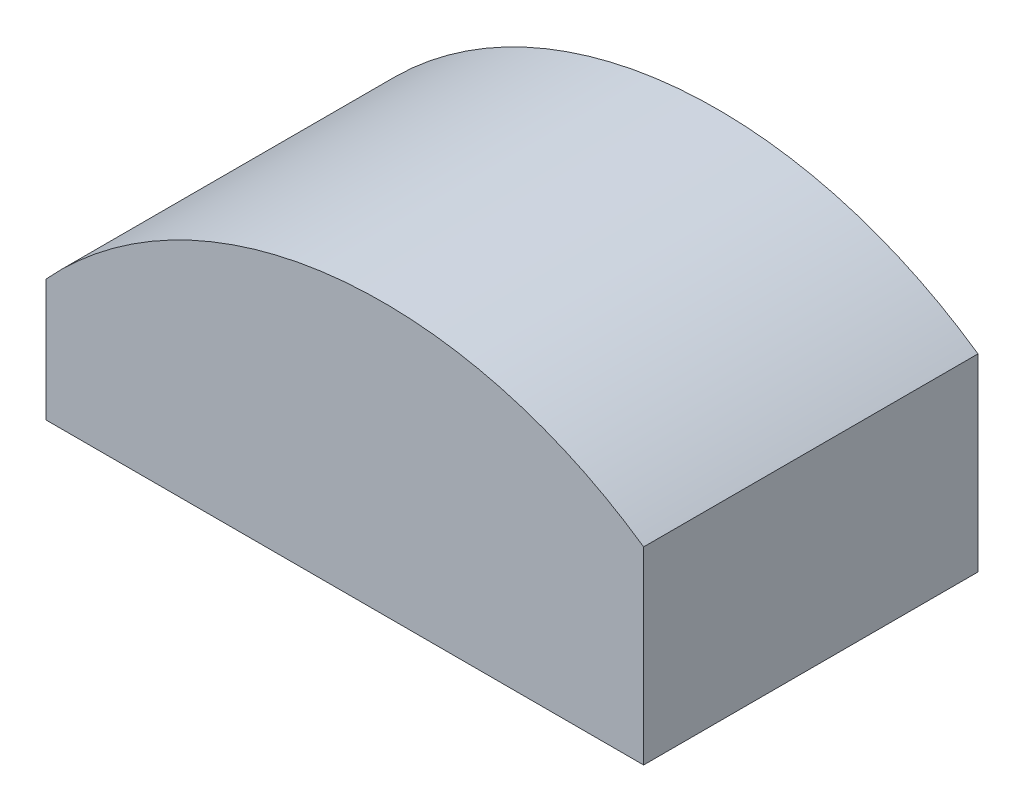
from build123d import *

# Parameters (mm, degrees)
SKETCH1_W                = 109.029585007
SKETCH1_H                = 51.429049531
EXTRUDE1_DEPTH           = 61
SURFACE_EXTRUDE1_1_BACK  = 79
SURFACE_EXTRUDE1_1_DEPTH = 98.196864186


with BuildPart() as part:
    # Sketch1 → Extrude1 (new body)
    with BuildSketch(Plane.XY):
        with Locations((54.514792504, 25.714524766)):
            Rectangle(SKETCH1_W, SKETCH1_H)
    extrude(amount=EXTRUDE1_DEPTH)

    # SurfaceCut1: cut with a surface, the side behind it stays
    # Surface-Extrude1: a surface, the sketch's curves swept straight by 98.196864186 mm
    with BuildLine(Plane.XY.offset(61).offset(-SURFACE_EXTRUDE1_1_BACK), mode=Mode.PRIVATE) as surface_extrude1_1_path:
        ThreePointArc((-4.273285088, 17.20038939), (51.167584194, 48.71468941), (112.654174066, 31.796050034))
    surface_extrude1_1 = Shell.extrude(surface_extrude1_1_path.wire(), (0 * SURFACE_EXTRUDE1_1_DEPTH, 0 * SURFACE_EXTRUDE1_1_DEPTH, 1 * SURFACE_EXTRUDE1_1_DEPTH))
    split(bisect_by=surface_extrude1_1, keep=Keep.BOTTOM)


solid = part.part
